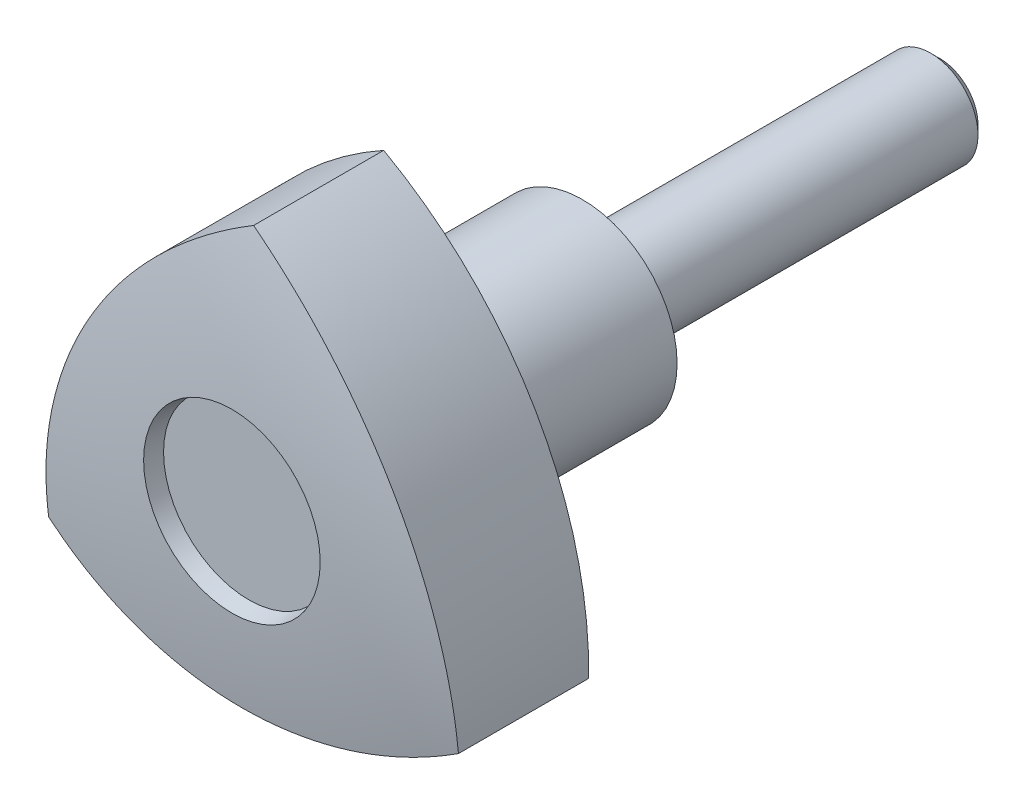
ISO-10303-21;
HEADER;
FILE_DESCRIPTION(('STEP AP214'),'2;1');
FILE_NAME('part.step','',(''),(''),'','','');
FILE_SCHEMA(('AUTOMOTIVE_DESIGN { 1 0 10303 214 1 1 1 1 }'));
ENDSEC;
DATA;
#1=APPLICATION_CONTEXT('core data for automotive mechanical design processes');
#2=APPLICATION_PROTOCOL_DEFINITION('international standard','automotive_design',2000,#1);
#3=PRODUCT_CONTEXT('',#1,'mechanical');
#4=PRODUCT('Part','Part','',(#3));
#5=PRODUCT_RELATED_PRODUCT_CATEGORY('part','',(#4));
#6=PRODUCT_DEFINITION_FORMATION('','',#4);
#7=PRODUCT_DEFINITION_CONTEXT('part definition',#1,'design');
#8=PRODUCT_DEFINITION('design','',#6,#7);
#9=PRODUCT_DEFINITION_SHAPE('','',#8);
#10=(LENGTH_UNIT() NAMED_UNIT(*) SI_UNIT(.MILLI.,.METRE.));
#11=(NAMED_UNIT(*) PLANE_ANGLE_UNIT() SI_UNIT($,.RADIAN.));
#12=(NAMED_UNIT(*) SI_UNIT($,.STERADIAN.) SOLID_ANGLE_UNIT());
#13=UNCERTAINTY_MEASURE_WITH_UNIT(LENGTH_MEASURE(1.E-05),#10,'distance_accuracy_value','');
#14=(GEOMETRIC_REPRESENTATION_CONTEXT(3) GLOBAL_UNCERTAINTY_ASSIGNED_CONTEXT((#13)) GLOBAL_UNIT_ASSIGNED_CONTEXT((#10,
#11,#12)) REPRESENTATION_CONTEXT('',''));
#15=CARTESIAN_POINT('',(0.,0.,0.));
#16=DIRECTION('',(0.,0.,1.));
#17=DIRECTION('',(1.,0.,0.));
#18=AXIS2_PLACEMENT_3D('',#15,#16,#17);
#19=CARTESIAN_POINT('',(0.,-5.2,17.));
#20=DIRECTION('',(0.,0.,-1.));
#21=DIRECTION('',(1.,0.,0.));
#22=AXIS2_PLACEMENT_3D('',#19,#20,#21);
#23=PLANE('',#22);
#24=CARTESIAN_POINT('',(0.,0.,17.));
#25=DIRECTION('',(0.,0.,1.));
#26=DIRECTION('',(-1.,0.,0.));
#27=AXIS2_PLACEMENT_3D('',#24,#25,#26);
#28=CIRCLE('',#27,5.2);
#29=CARTESIAN_POINT('',(-5.2,0.,17.));
#30=VERTEX_POINT('',#29);
#31=EDGE_CURVE('E19',#30,#30,#28,.T.);
#32=ORIENTED_EDGE('',*,*,#31,.T.);
#33=EDGE_LOOP('',(#32));
#34=FACE_BOUND('',#33,.T.);
#35=ADVANCED_FACE('F14',(#34),#23,.F.);
#36=CARTESIAN_POINT('',(0.,0.,27.3333333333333));
#37=DIRECTION('',(0.,0.,1.));
#38=DIRECTION('',(-1.,0.,0.));
#39=AXIS2_PLACEMENT_3D('',#36,#37,#38);
#40=CONICAL_SURFACE('',#39,7.02204546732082,0.174532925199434);
#41=CARTESIAN_POINT('',(0.,0.,27.3333333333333));
#42=DIRECTION('',(0.,0.,1.));
#43=DIRECTION('',(-1.,0.,0.));
#44=AXIS2_PLACEMENT_3D('',#41,#42,#43);
#45=CIRCLE('',#44,7.02204546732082);
#46=CARTESIAN_POINT('',(-7.02204546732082,0.,27.3333333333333));
#47=VERTEX_POINT('',#46);
#48=EDGE_CURVE('E138',#47,#47,#45,.T.);
#49=ORIENTED_EDGE('',*,*,#48,.T.);
#50=EDGE_LOOP('',(#49));
#51=FACE_BOUND('',#50,.T.);
#52=ORIENTED_EDGE('',*,*,#31,.F.);
#53=EDGE_LOOP('',(#52));
#54=FACE_BOUND('',#53,.T.);
#55=ADVANCED_FACE('F146',(#51,#54),#40,.F.);
#56=CARTESIAN_POINT('',(0.,-0.000999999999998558,27.3333333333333));
#57=DIRECTION('',(0.,0.,1.));
#58=DIRECTION('',(-1.,0.,0.));
#59=AXIS2_PLACEMENT_3D('',#56,#57,#58);
#60=PLANE('',#59);
#61=CARTESIAN_POINT('',(0.,0.,27.3333333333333));
#62=DIRECTION('',(0.,0.,-1.));
#63=DIRECTION('',(1.,0.,0.));
#64=AXIS2_PLACEMENT_3D('',#61,#62,#63);
#65=CIRCLE('',#64,0.000999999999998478);
#66=CARTESIAN_POINT('',(0.000999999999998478,0.,27.3333333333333));
#67=VERTEX_POINT('',#66);
#68=EDGE_CURVE('E136',#67,#67,#65,.F.);
#69=ORIENTED_EDGE('',*,*,#68,.T.);
#70=EDGE_LOOP('',(#69));
#71=FACE_BOUND('',#70,.T.);
#72=ORIENTED_EDGE('',*,*,#48,.F.);
#73=EDGE_LOOP('',(#72));
#74=FACE_BOUND('',#73,.T.);
#75=ADVANCED_FACE('F148',(#71,#74),#60,.F.);
#76=CARTESIAN_POINT('',(0.,0.,17.));
#77=DIRECTION('',(0.,0.,-1.));
#78=DIRECTION('',(1.,0.,0.));
#79=AXIS2_PLACEMENT_3D('',#76,#77,#78);
#80=CYLINDRICAL_SURFACE('',#79,0.000999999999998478);
#81=CARTESIAN_POINT('',(0.,0.,28.4));
#82=DIRECTION('',(0.,0.,-1.));
#83=DIRECTION('',(1.,0.,0.));
#84=AXIS2_PLACEMENT_3D('',#81,#82,#83);
#85=CIRCLE('',#84,0.000999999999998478);
#86=CARTESIAN_POINT('',(0.000999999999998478,0.,28.4));
#87=VERTEX_POINT('',#86);
#88=EDGE_CURVE('E133',#87,#87,#85,.F.);
#89=ORIENTED_EDGE('',*,*,#88,.T.);
#90=EDGE_LOOP('',(#89));
#91=FACE_BOUND('',#90,.T.);
#92=ORIENTED_EDGE('',*,*,#68,.F.);
#93=EDGE_LOOP('',(#92));
#94=FACE_BOUND('',#93,.T.);
#95=ADVANCED_FACE('F155',(#91,#94),#80,.F.);
#96=CARTESIAN_POINT('',(0.,0.,-30.));
#97=DIRECTION('',(0.,0.,1.));
#98=DIRECTION('',(-1.,0.,0.));
#99=AXIS2_PLACEMENT_3D('',#96,#97,#98);
#100=PLANE('',#99);
#101=CARTESIAN_POINT('',(0.,0.,-30.0000000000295));
#102=DIRECTION('',(0.,0.,1.));
#103=DIRECTION('',(-1.,0.,0.));
#104=AXIS2_PLACEMENT_3D('',#101,#102,#103);
#105=CIRCLE('',#104,3.23300000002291);
#106=CARTESIAN_POINT('',(-3.23300000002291,0.,-30.0000000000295));
#107=VERTEX_POINT('',#106);
#108=EDGE_CURVE('E130',#107,#107,#105,.T.);
#109=ORIENTED_EDGE('',*,*,#108,.F.);
#110=EDGE_LOOP('',(#109));
#111=FACE_BOUND('',#110,.T.);
#112=ADVANCED_FACE('F211',(#111),#100,.F.);
#113=CARTESIAN_POINT('',(0.,-7.2101275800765,28.4));
#114=DIRECTION('',(0.,0.,-1.));
#115=DIRECTION('',(1.,0.,0.));
#116=AXIS2_PLACEMENT_3D('',#113,#114,#115);
#117=PLANE('',#116);
#118=CARTESIAN_POINT('',(0.,0.,28.4));
#119=DIRECTION('',(0.,0.,1.));
#120=DIRECTION('',(-1.,0.,0.));
#121=AXIS2_PLACEMENT_3D('',#118,#119,#120);
#122=CIRCLE('',#121,7.21012758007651);
#123=CARTESIAN_POINT('',(-7.21012758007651,0.,28.4));
#124=VERTEX_POINT('',#123);
#125=EDGE_CURVE('E82',#124,#124,#122,.T.);
#126=ORIENTED_EDGE('',*,*,#125,.T.);
#127=EDGE_LOOP('',(#126));
#128=FACE_BOUND('',#127,.T.);
#129=ORIENTED_EDGE('',*,*,#88,.F.);
#130=EDGE_LOOP('',(#129));
#131=FACE_BOUND('',#130,.T.);
#132=ADVANCED_FACE('F207',(#128,#131),#117,.F.);
#133=CARTESIAN_POINT('',(0.,0.,-29.2330000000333));
#134=DIRECTION('',(0.,0.,1.));
#135=DIRECTION('',(-1.,0.,0.));
#136=AXIS2_PLACEMENT_3D('',#133,#134,#135);
#137=CONICAL_SURFACE('',#136,4.0000000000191,0.785398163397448);
#138=ORIENTED_EDGE('',*,*,#108,.T.);
#139=EDGE_LOOP('',(#138));
#140=FACE_BOUND('',#139,.T.);
#141=CARTESIAN_POINT('',(0.,0.,-29.233));
#142=DIRECTION('',(0.,0.,-1.));
#143=DIRECTION('',(1.,0.,0.));
#144=AXIS2_PLACEMENT_3D('',#141,#142,#143);
#145=CIRCLE('',#144,4.);
#146=CARTESIAN_POINT('',(4.,0.,-29.233));
#147=VERTEX_POINT('',#146);
#148=EDGE_CURVE('E77',#147,#147,#145,.F.);
#149=ORIENTED_EDGE('',*,*,#148,.F.);
#150=EDGE_LOOP('',(#149));
#151=FACE_BOUND('',#150,.T.);
#152=ADVANCED_FACE('F201',(#140,#151),#137,.T.);
#153=CARTESIAN_POINT('',(0.,0.,29.8316989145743));
#154=DIRECTION('',(0.,0.,1.));
#155=DIRECTION('',(-1.,0.,0.));
#156=AXIS2_PLACEMENT_3D('',#153,#154,#155);
#157=CONICAL_SURFACE('',#156,7.4625747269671,0.174532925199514);
#158=CARTESIAN_POINT('',(0.,0.,29.8316989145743));
#159=DIRECTION('',(0.,0.,-1.));
#160=DIRECTION('',(1.,0.,0.));
#161=AXIS2_PLACEMENT_3D('',#158,#159,#160);
#162=CIRCLE('',#161,7.46257472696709);
#163=CARTESIAN_POINT('',(7.46257472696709,0.,29.8316989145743));
#164=VERTEX_POINT('',#163);
#165=EDGE_CURVE('E74',#164,#164,#162,.T.);
#166=ORIENTED_EDGE('',*,*,#165,.F.);
#167=EDGE_LOOP('',(#166));
#168=FACE_BOUND('',#167,.T.);
#169=ORIENTED_EDGE('',*,*,#125,.F.);
#170=EDGE_LOOP('',(#169));
#171=FACE_BOUND('',#170,.T.);
#172=ADVANCED_FACE('F196',(#168,#171),#157,.F.);
#173=CARTESIAN_POINT('',(0.,0.,17.));
#174=DIRECTION('',(0.,0.,-1.));
#175=DIRECTION('',(1.,0.,0.));
#176=AXIS2_PLACEMENT_3D('',#173,#174,#175);
#177=CYLINDRICAL_SURFACE('',#176,4.);
#178=ORIENTED_EDGE('',*,*,#148,.T.);
#179=EDGE_LOOP('',(#178));
#180=FACE_BOUND('',#179,.T.);
#181=CARTESIAN_POINT('',(0.,0.,0.));
#182=DIRECTION('',(0.,0.,-1.));
#183=DIRECTION('',(1.,0.,0.));
#184=AXIS2_PLACEMENT_3D('',#181,#182,#183);
#185=CIRCLE('',#184,4.);
#186=CARTESIAN_POINT('',(4.,0.,0.));
#187=VERTEX_POINT('',#186);
#188=EDGE_CURVE('E59',#187,#187,#185,.T.);
#189=ORIENTED_EDGE('',*,*,#188,.T.);
#190=EDGE_LOOP('',(#189));
#191=FACE_BOUND('',#190,.T.);
#192=ADVANCED_FACE('F191',(#180,#191),#177,.T.);
#193=CARTESIAN_POINT('',(0.,0.,-52.2083333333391));
#194=DIRECTION('',(0.,0.,1.));
#195=DIRECTION('',(-1.,0.,0.));
#196=AXIS2_PLACEMENT_3D('',#193,#194,#195);
#197=DEGENERATE_TOROIDAL_SURFACE('',#196,1.87916666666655,82.2298080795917,.T.);
#198=ORIENTED_EDGE('',*,*,#165,.T.);
#199=EDGE_LOOP('',(#198));
#200=FACE_BOUND('',#199,.T.);
#201=CARTESIAN_POINT('',(0.,20.,28.));
#202=CARTESIAN_POINT('',(0.372642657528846,19.7932630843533,28.0467066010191));
#203=CARTESIAN_POINT('',(0.74147156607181,19.5793830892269,28.0918331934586));
#204=CARTESIAN_POINT('',(1.47101156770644,19.1375865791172,28.178894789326));
#205=CARTESIAN_POINT('',(1.83172263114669,18.9096700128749,28.2208297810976));
#206=CARTESIAN_POINT('',(2.90076609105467,18.2053565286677,28.3417798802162));
#207=CARTESIAN_POINT('',(3.59619057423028,17.7082949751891,28.4159628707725));
#208=CARTESIAN_POINT('',(4.94790509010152,16.6620571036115,28.5511708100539));
#209=CARTESIAN_POINT('',(5.60419538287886,16.1128811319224,28.6121958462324));
#210=CARTESIAN_POINT('',(6.87366086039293,14.9654936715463,28.7209726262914));
#211=CARTESIAN_POINT('',(7.48683405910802,14.3672799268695,28.7687237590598));
#212=CARTESIAN_POINT('',(8.71865863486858,13.0700716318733,28.8545535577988));
#213=CARTESIAN_POINT('',(9.33294869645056,12.366845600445,28.8913945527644));
#214=CARTESIAN_POINT('',(10.5012836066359,10.9113370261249,28.9492833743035));
#215=CARTESIAN_POINT('',(11.0553238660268,10.1590507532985,28.9703299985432));
#216=CARTESIAN_POINT('',(12.0991453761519,8.61069429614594,28.996665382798));
#217=CARTESIAN_POINT('',(12.588915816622,7.81461677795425,29.0019514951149));
#218=CARTESIAN_POINT('',(13.5005090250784,6.18456766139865,28.9967711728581));
#219=CARTESIAN_POINT('',(13.9223353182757,5.35059803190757,28.9863055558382));
#220=CARTESIAN_POINT('',(14.692719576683,3.65593233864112,28.9497108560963));
#221=CARTESIAN_POINT('',(15.0417071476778,2.79542945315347,28.9236773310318));
#222=CARTESIAN_POINT('',(15.6672761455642,1.04897441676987,28.8559880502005));
#223=CARTESIAN_POINT('',(15.9438491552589,0.16301932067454,28.8143304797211));
#224=CARTESIAN_POINT('',(16.4224738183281,-1.62689638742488,28.7154571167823));
#225=CARTESIAN_POINT('',(16.6246054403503,-2.5308365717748,28.6582581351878));
#226=CARTESIAN_POINT('',(16.9534969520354,-4.35087123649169,28.5284012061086));
#227=CARTESIAN_POINT('',(17.0802911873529,-5.26695998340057,28.4557503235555));
#228=CARTESIAN_POINT('',(17.2305634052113,-6.82078728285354,28.3200368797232));
#229=CARTESIAN_POINT('',(17.2738628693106,-7.45703003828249,28.2609528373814));
#230=CARTESIAN_POINT('',(17.3242365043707,-8.72906049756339,28.1357415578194));
#231=CARTESIAN_POINT('',(17.3313778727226,-9.36484684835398,28.0696276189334));
#232=CARTESIAN_POINT('',(17.3205080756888,-10.,28.));
#233=B_SPLINE_CURVE_WITH_KNOTS('',3,(#201,#202,#203,#204,#205,#206,#207,#208,#209,#210,#211,
#212,#213,#214,#215,#216,#217,#218,#219,#220,#221,#222,#223,#224,#225,#226,#227,#228,#229,#230,
#231,#232),.UNSPECIFIED.,.F.,.F.,(4,2,2,2,2,2,2,2,2,2,2,2,2,2,2,4),(0.,1.28593682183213,
2.5718783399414,5.14313559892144,7.71437576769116,10.2857342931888,13.0857434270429,
15.8859656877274,18.6866583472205,21.4872056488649,24.2707368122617,27.0545913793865,
29.835446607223,32.6150330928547,34.5353707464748,36.4521382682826),.UNSPECIFIED.);
#234=CARTESIAN_POINT('',(0.,20.,28.));
#235=VERTEX_POINT('',#234);
#236=CARTESIAN_POINT('',(17.3205080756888,-10.,28.));
#237=VERTEX_POINT('',#236);
#238=EDGE_CURVE('E49',#235,#237,#233,.T.);
#239=ORIENTED_EDGE('',*,*,#238,.F.);
#240=CARTESIAN_POINT('',(-17.3205080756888,-10.,28.));
#241=CARTESIAN_POINT('',(-17.3277899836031,-9.57391353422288,28.0467066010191));
#242=CARTESIAN_POINT('',(-17.3269789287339,-9.14755833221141,28.0918331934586));
#243=CARTESIAN_POINT('',(-17.3091419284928,-8.29485990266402,28.178894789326));
#244=CARTESIAN_POINT('',(-17.2921159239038,-7.86851667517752,28.2208297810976));
#245=CARTESIAN_POINT('',(-17.2166842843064,-6.59054113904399,28.3417798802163));
#246=CARTESIAN_POINT('',(-17.1339285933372,-5.73975509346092,28.4159628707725));
#247=CARTESIAN_POINT('',(-16.9037172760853,-4.04601704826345,28.5511708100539));
#248=CARTESIAN_POINT('',(-16.7562620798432,-3.2030649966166,28.6121958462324));
#249=CARTESIAN_POINT('',(-16.3973281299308,-1.52998191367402,28.7209726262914));
#250=CARTESIAN_POINT('',(-16.1858464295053,-0.699851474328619,28.7687237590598));
#251=CARTESIAN_POINT('',(-15.6783433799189,1.01554404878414,28.8545535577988));
#252=CARTESIAN_POINT('',(-15.3764768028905,1.89914786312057,28.8913945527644));
#253=CARTESIAN_POINT('',(-14.7001368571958,3.63870986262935,28.9492833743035));
#254=CARTESIAN_POINT('',(-14.3256579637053,4.49466593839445,28.9703299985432));
#255=CARTESIAN_POINT('',(-13.5066526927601,6.1728201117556,28.996665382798));
#256=CARTESIAN_POINT('',(-13.0621145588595,6.99501251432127,29.0019514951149));
#257=CARTESIAN_POINT('',(-12.1062472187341,8.59949994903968,28.9967711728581));
#258=CARTESIAN_POINT('',(-11.5949214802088,9.38179704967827,28.9863055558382));
#259=CARTESIAN_POINT('',(-10.5124900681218,10.8963022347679,28.9497108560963));
#260=CARTESIAN_POINT('',(-9.94176649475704,11.6287857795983,28.9236773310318));
#261=CARTESIAN_POINT('',(-8.74207656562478,13.0437719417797,28.8559880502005));
#262=CARTESIAN_POINT('',(-8.11310345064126,13.726268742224,28.8143304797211));
#263=CARTESIAN_POINT('',(-6.80230330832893,15.0357277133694,28.7154571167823));
#264=CARTESIAN_POINT('',(-6.12053395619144,15.6627489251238,28.6582581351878));
#265=CARTESIAN_POINT('',(-4.70878345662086,16.8575946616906,28.5284012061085));
#266=CARTESIAN_POINT('',(-3.97882444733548,17.4254460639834,28.4557503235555));
#267=CARTESIAN_POINT('',(-2.70830664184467,18.3324992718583,28.3200368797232));
#268=CARTESIAN_POINT('',(-2.17895398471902,18.688119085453,28.2609528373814));
#269=CARTESIAN_POINT('',(-1.10253011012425,19.3677591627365,28.1357415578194));
#270=CARTESIAN_POINT('',(-0.555493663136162,19.6918369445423,28.0696276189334));
#271=CARTESIAN_POINT('',(0.,20.,28.));
#272=B_SPLINE_CURVE_WITH_KNOTS('',3,(#240,#241,#242,#243,#244,#245,#246,#247,#248,#249,#250,
#251,#252,#253,#254,#255,#256,#257,#258,#259,#260,#261,#262,#263,#264,#265,#266,#267,#268,#269,
#270,#271),.UNSPECIFIED.,.F.,.F.,(4,2,2,2,2,2,2,2,2,2,2,2,2,2,2,4),(0.,1.28593682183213,
2.5718783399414,5.14313559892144,7.71437576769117,10.2857342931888,13.0857434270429,
15.8859656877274,18.6866583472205,21.4872056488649,24.2707368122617,27.0545913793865,
29.835446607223,32.6150330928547,34.5353707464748,36.4521382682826),.UNSPECIFIED.);
#273=CARTESIAN_POINT('',(-17.3205080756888,-10.,28.));
#274=VERTEX_POINT('',#273);
#275=EDGE_CURVE('E58',#274,#235,#272,.T.);
#276=ORIENTED_EDGE('',*,*,#275,.F.);
#277=CARTESIAN_POINT('',(17.3205080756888,-10.,28.));
#278=CARTESIAN_POINT('',(16.9551473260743,-10.2193495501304,28.0467066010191));
#279=CARTESIAN_POINT('',(16.5855073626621,-10.4318247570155,28.0918331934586));
#280=CARTESIAN_POINT('',(15.8381303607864,-10.8427266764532,28.178894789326));
#281=CARTESIAN_POINT('',(15.4603932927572,-11.0411533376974,28.2208297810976));
#282=CARTESIAN_POINT('',(14.3159181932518,-11.6148153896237,28.3417798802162));
#283=CARTESIAN_POINT('',(13.5377380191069,-11.9685398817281,28.4159628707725));
#284=CARTESIAN_POINT('',(11.9558121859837,-12.616040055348,28.5511708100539));
#285=CARTESIAN_POINT('',(11.1520666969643,-12.9098161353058,28.6121958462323));
#286=CARTESIAN_POINT('',(9.52366726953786,-13.4355117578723,28.7209726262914));
#287=CARTESIAN_POINT('',(8.69901237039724,-13.6674284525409,28.7687237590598));
#288=CARTESIAN_POINT('',(6.9596847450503,-14.0856156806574,28.8545535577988));
#289=CARTESIAN_POINT('',(6.04352810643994,-14.2659934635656,28.8913945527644));
#290=CARTESIAN_POINT('',(4.19885325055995,-14.5500468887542,28.9492833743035));
#291=CARTESIAN_POINT('',(3.27033409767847,-14.6537166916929,28.9703299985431));
#292=CARTESIAN_POINT('',(1.40750731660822,-14.7835144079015,28.996665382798));
#293=CARTESIAN_POINT('',(0.473198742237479,-14.8096292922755,29.0019514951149));
#294=CARTESIAN_POINT('',(-1.39426180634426,-14.7840676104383,28.9967711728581));
#295=CARTESIAN_POINT('',(-2.32741383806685,-14.7323950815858,28.9863055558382));
#296=CARTESIAN_POINT('',(-4.18022950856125,-14.552234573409,28.9497108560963));
#297=CARTESIAN_POINT('',(-5.09994065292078,-14.4242152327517,28.9236773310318));
#298=CARTESIAN_POINT('',(-6.92519957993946,-14.0927463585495,28.8559880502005));
#299=CARTESIAN_POINT('',(-7.83074570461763,-13.8892880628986,28.8143304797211));
#300=CARTESIAN_POINT('',(-9.62017050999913,-13.4088313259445,28.7154571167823));
#301=CARTESIAN_POINT('',(-10.5040714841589,-13.131912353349,28.6582581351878));
#302=CARTESIAN_POINT('',(-12.2447134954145,-12.5067234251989,28.5284012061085));
#303=CARTESIAN_POINT('',(-13.1014667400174,-12.1584860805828,28.4557503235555));
#304=CARTESIAN_POINT('',(-14.5222567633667,-11.5117119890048,28.3200368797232));
#305=CARTESIAN_POINT('',(-15.0949088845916,-11.2310890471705,28.2609528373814));
#306=CARTESIAN_POINT('',(-16.2217063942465,-10.6386986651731,28.1357415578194));
#307=CARTESIAN_POINT('',(-16.7758842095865,-10.3269900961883,28.0696276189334));
#308=CARTESIAN_POINT('',(-17.3205080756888,-10.,28.));
#309=B_SPLINE_CURVE_WITH_KNOTS('',3,(#277,#278,#279,#280,#281,#282,#283,#284,#285,#286,#287,
#288,#289,#290,#291,#292,#293,#294,#295,#296,#297,#298,#299,#300,#301,#302,#303,#304,#305,#306,
#307,#308),.UNSPECIFIED.,.F.,.F.,(4,2,2,2,2,2,2,2,2,2,2,2,2,2,2,4),(0.,1.28593682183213,
2.5718783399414,5.14313559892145,7.71437576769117,10.2857342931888,13.0857434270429,
15.8859656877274,18.6866583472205,21.4872056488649,24.2707368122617,27.0545913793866,
29.8354466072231,32.6150330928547,34.5353707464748,36.4521382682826),.UNSPECIFIED.);
#310=EDGE_CURVE('E62',#237,#274,#309,.T.);
#311=ORIENTED_EDGE('',*,*,#310,.F.);
#312=EDGE_LOOP('',(#239,#276,#311));
#313=FACE_BOUND('',#312,.T.);
#314=ADVANCED_FACE('F16',(#200,#313),#197,.T.);
#315=CARTESIAN_POINT('',(0.,-4.,0.));
#316=DIRECTION('',(0.,0.,1.));
#317=DIRECTION('',(-1.,0.,0.));
#318=AXIS2_PLACEMENT_3D('',#315,#316,#317);
#319=PLANE('',#318);
#320=ORIENTED_EDGE('',*,*,#188,.F.);
#321=EDGE_LOOP('',(#320));
#322=FACE_BOUND('',#321,.T.);
#323=CARTESIAN_POINT('',(0.,0.,0.));
#324=DIRECTION('',(0.,0.,-1.));
#325=DIRECTION('',(1.,0.,0.));
#326=AXIS2_PLACEMENT_3D('',#323,#324,#325);
#327=CIRCLE('',#326,5.2);
#328=CARTESIAN_POINT('',(5.2,0.,0.));
#329=VERTEX_POINT('',#328);
#330=EDGE_CURVE('E94',#329,#329,#327,.F.);
#331=ORIENTED_EDGE('',*,*,#330,.F.);
#332=EDGE_LOOP('',(#331));
#333=FACE_BOUND('',#332,.T.);
#334=ADVANCED_FACE('F119',(#322,#333),#319,.F.);
#335=CARTESIAN_POINT('',(-16.3245788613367,-9.425,40.));
#336=DIRECTION('',(0.,0.,1.));
#337=DIRECTION('',(-1.,0.,0.));
#338=AXIS2_PLACEMENT_3D('',#335,#336,#337);
#339=CYLINDRICAL_SURFACE('',#338,33.65);
#340=DIRECTION('',(0.,0.,1.));
#341=VECTOR('',#340,1.);
#342=CARTESIAN_POINT('',(17.3205080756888,-10.,40.));
#343=LINE('',#342,#341);
#344=CARTESIAN_POINT('',(17.3205080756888,-10.,17.));
#345=VERTEX_POINT('',#344);
#346=EDGE_CURVE('E54',#345,#237,#343,.T.);
#347=ORIENTED_EDGE('',*,*,#346,.F.);
#348=CARTESIAN_POINT('',(-16.3245788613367,-9.425,17.));
#349=DIRECTION('',(0.,0.,1.));
#350=DIRECTION('',(-1.,0.,0.));
#351=AXIS2_PLACEMENT_3D('',#348,#349,#350);
#352=CIRCLE('',#351,33.65);
#353=CARTESIAN_POINT('',(0.,20.,17.));
#354=VERTEX_POINT('',#353);
#355=EDGE_CURVE('E92',#345,#354,#352,.T.);
#356=ORIENTED_EDGE('',*,*,#355,.T.);
#357=DIRECTION('',(0.,0.,1.));
#358=VECTOR('',#357,1.);
#359=CARTESIAN_POINT('',(0.,20.,40.));
#360=LINE('',#359,#358);
#361=EDGE_CURVE('E56',#235,#354,#360,.F.);
#362=ORIENTED_EDGE('',*,*,#361,.F.);
#363=ORIENTED_EDGE('',*,*,#238,.T.);
#364=EDGE_LOOP('',(#347,#356,#362,#363));
#365=FACE_BOUND('',#364,.T.);
#366=ADVANCED_FACE('F52',(#365),#339,.T.);
#367=CARTESIAN_POINT('',(16.3245788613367,-9.425,40.));
#368=DIRECTION('',(0.,0.,1.));
#369=DIRECTION('',(-1.,0.,0.));
#370=AXIS2_PLACEMENT_3D('',#367,#368,#369);
#371=CYLINDRICAL_SURFACE('',#370,33.65);
#372=ORIENTED_EDGE('',*,*,#361,.T.);
#373=CARTESIAN_POINT('',(16.3245788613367,-9.425,17.));
#374=DIRECTION('',(0.,0.,1.));
#375=DIRECTION('',(-1.,0.,0.));
#376=AXIS2_PLACEMENT_3D('',#373,#374,#375);
#377=CIRCLE('',#376,33.65);
#378=CARTESIAN_POINT('',(-17.3205080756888,-10.,17.));
#379=VERTEX_POINT('',#378);
#380=EDGE_CURVE('E34',#354,#379,#377,.T.);
#381=ORIENTED_EDGE('',*,*,#380,.T.);
#382=DIRECTION('',(0.,0.,1.));
#383=VECTOR('',#382,1.);
#384=CARTESIAN_POINT('',(-17.3205080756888,-10.,40.));
#385=LINE('',#384,#383);
#386=EDGE_CURVE('E64',#274,#379,#385,.F.);
#387=ORIENTED_EDGE('',*,*,#386,.F.);
#388=ORIENTED_EDGE('',*,*,#275,.T.);
#389=EDGE_LOOP('',(#372,#381,#387,#388));
#390=FACE_BOUND('',#389,.T.);
#391=ADVANCED_FACE('F111',(#390),#371,.T.);
#392=CARTESIAN_POINT('',(0.,18.85,40.));
#393=DIRECTION('',(0.,0.,1.));
#394=DIRECTION('',(-1.,0.,0.));
#395=AXIS2_PLACEMENT_3D('',#392,#393,#394);
#396=CYLINDRICAL_SURFACE('',#395,33.65);
#397=ORIENTED_EDGE('',*,*,#386,.T.);
#398=CARTESIAN_POINT('',(0.,18.85,17.));
#399=DIRECTION('',(0.,0.,1.));
#400=DIRECTION('',(-1.,0.,0.));
#401=AXIS2_PLACEMENT_3D('',#398,#399,#400);
#402=CIRCLE('',#401,33.65);
#403=EDGE_CURVE('E68',#379,#345,#402,.T.);
#404=ORIENTED_EDGE('',*,*,#403,.T.);
#405=ORIENTED_EDGE('',*,*,#346,.T.);
#406=ORIENTED_EDGE('',*,*,#310,.T.);
#407=EDGE_LOOP('',(#397,#404,#405,#406));
#408=FACE_BOUND('',#407,.T.);
#409=ADVANCED_FACE('F66',(#408),#396,.T.);
#410=CARTESIAN_POINT('',(0.,0.,17.));
#411=DIRECTION('',(0.,0.,-1.));
#412=DIRECTION('',(1.,0.,0.));
#413=AXIS2_PLACEMENT_3D('',#410,#411,#412);
#414=CYLINDRICAL_SURFACE('',#413,5.2);
#415=ORIENTED_EDGE('',*,*,#330,.T.);
#416=EDGE_LOOP('',(#415));
#417=FACE_BOUND('',#416,.T.);
#418=CARTESIAN_POINT('',(0.,0.,0.2));
#419=DIRECTION('',(0.,0.,-1.));
#420=DIRECTION('',(1.,0.,0.));
#421=AXIS2_PLACEMENT_3D('',#418,#419,#420);
#422=CIRCLE('',#421,5.2);
#423=CARTESIAN_POINT('',(5.2,0.,0.2));
#424=VERTEX_POINT('',#423);
#425=EDGE_CURVE('E87',#424,#424,#422,.T.);
#426=ORIENTED_EDGE('',*,*,#425,.T.);
#427=EDGE_LOOP('',(#426));
#428=FACE_BOUND('',#427,.T.);
#429=ADVANCED_FACE('F110',(#417,#428),#414,.T.);
#430=CARTESIAN_POINT('',(0.,-8.,17.));
#431=DIRECTION('',(0.,0.,1.));
#432=DIRECTION('',(-1.,0.,0.));
#433=AXIS2_PLACEMENT_3D('',#430,#431,#432);
#434=PLANE('',#433);
#435=CARTESIAN_POINT('',(0.,0.,17.));
#436=DIRECTION('',(0.,0.,-1.));
#437=DIRECTION('',(1.,0.,0.));
#438=AXIS2_PLACEMENT_3D('',#435,#436,#437);
#439=CIRCLE('',#438,8.);
#440=CARTESIAN_POINT('',(8.,0.,17.));
#441=VERTEX_POINT('',#440);
#442=EDGE_CURVE('E25',#441,#441,#439,.T.);
#443=ORIENTED_EDGE('',*,*,#442,.F.);
#444=EDGE_LOOP('',(#443));
#445=FACE_BOUND('',#444,.T.);
#446=ORIENTED_EDGE('',*,*,#380,.F.);
#447=ORIENTED_EDGE('',*,*,#355,.F.);
#448=ORIENTED_EDGE('',*,*,#403,.F.);
#449=EDGE_LOOP('',(#446,#447,#448));
#450=FACE_BOUND('',#449,.T.);
#451=ADVANCED_FACE('F166',(#445,#450),#434,.F.);
#452=CARTESIAN_POINT('',(0.,-5.2,0.2));
#453=DIRECTION('',(0.,0.,1.));
#454=DIRECTION('',(-1.,0.,0.));
#455=AXIS2_PLACEMENT_3D('',#452,#453,#454);
#456=PLANE('',#455);
#457=ORIENTED_EDGE('',*,*,#425,.F.);
#458=EDGE_LOOP('',(#457));
#459=FACE_BOUND('',#458,.T.);
#460=CARTESIAN_POINT('',(0.,0.,0.2));
#461=DIRECTION('',(0.,0.,-1.));
#462=DIRECTION('',(1.,0.,0.));
#463=AXIS2_PLACEMENT_3D('',#460,#461,#462);
#464=CIRCLE('',#463,8.);
#465=CARTESIAN_POINT('',(8.,0.,0.2));
#466=VERTEX_POINT('',#465);
#467=EDGE_CURVE('E9',#466,#466,#464,.F.);
#468=ORIENTED_EDGE('',*,*,#467,.F.);
#469=EDGE_LOOP('',(#468));
#470=FACE_BOUND('',#469,.T.);
#471=ADVANCED_FACE('F160',(#459,#470),#456,.F.);
#472=CARTESIAN_POINT('',(0.,0.,17.));
#473=DIRECTION('',(0.,0.,-1.));
#474=DIRECTION('',(1.,0.,0.));
#475=AXIS2_PLACEMENT_3D('',#472,#473,#474);
#476=CYLINDRICAL_SURFACE('',#475,8.);
#477=ORIENTED_EDGE('',*,*,#467,.T.);
#478=EDGE_LOOP('',(#477));
#479=FACE_BOUND('',#478,.T.);
#480=ORIENTED_EDGE('',*,*,#442,.T.);
#481=EDGE_LOOP('',(#480));
#482=FACE_BOUND('',#481,.T.);
#483=ADVANCED_FACE('F158',(#479,#482),#476,.T.);
#484=CLOSED_SHELL('',(#35,#55,#75,#95,#112,#132,#152,#172,#192,#314,#334,#366,#391,#409,#429,
#451,#471,#483));
#485=MANIFOLD_SOLID_BREP('B1',#484);
#486=ADVANCED_BREP_SHAPE_REPRESENTATION('',(#18,#485),#14);
#487=SHAPE_DEFINITION_REPRESENTATION(#9,#486);
ENDSEC;
END-ISO-10303-21;
